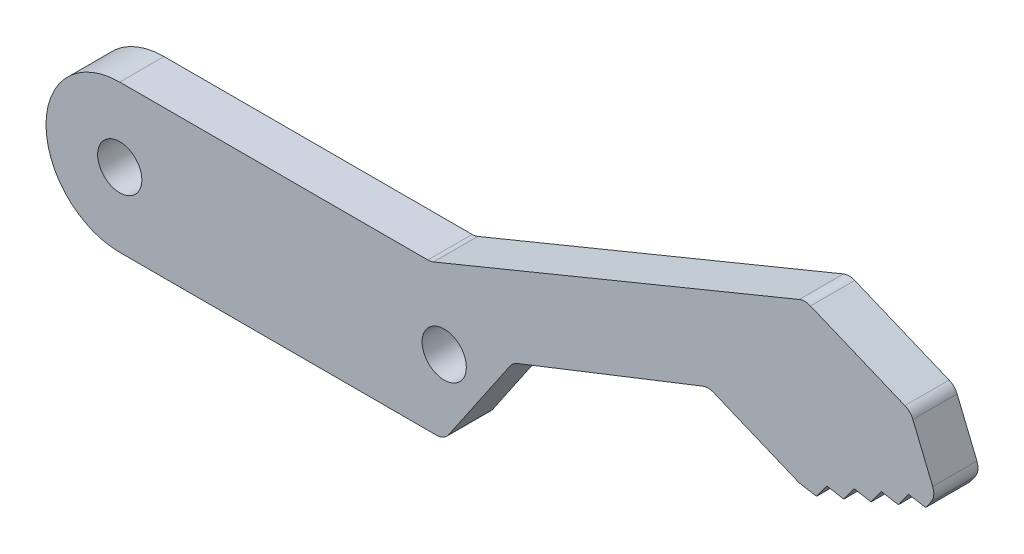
ISO-10303-21;
HEADER;
FILE_DESCRIPTION(('STEP AP214'),'2;1');
FILE_NAME('part.step','',(''),(''),'','','');
FILE_SCHEMA(('AUTOMOTIVE_DESIGN { 1 0 10303 214 1 1 1 1 }'));
ENDSEC;
DATA;
#1=APPLICATION_CONTEXT('core data for automotive mechanical design processes');
#2=APPLICATION_PROTOCOL_DEFINITION('international standard','automotive_design',2000,#1);
#3=PRODUCT_CONTEXT('',#1,'mechanical');
#4=PRODUCT('Part','Part','',(#3));
#5=PRODUCT_RELATED_PRODUCT_CATEGORY('part','',(#4));
#6=PRODUCT_DEFINITION_FORMATION('','',#4);
#7=PRODUCT_DEFINITION_CONTEXT('part definition',#1,'design');
#8=PRODUCT_DEFINITION('design','',#6,#7);
#9=PRODUCT_DEFINITION_SHAPE('','',#8);
#10=(LENGTH_UNIT() NAMED_UNIT(*) SI_UNIT(.MILLI.,.METRE.));
#11=(NAMED_UNIT(*) PLANE_ANGLE_UNIT() SI_UNIT($,.RADIAN.));
#12=(NAMED_UNIT(*) SI_UNIT($,.STERADIAN.) SOLID_ANGLE_UNIT());
#13=UNCERTAINTY_MEASURE_WITH_UNIT(LENGTH_MEASURE(1.E-05),#10,'distance_accuracy_value','');
#14=(GEOMETRIC_REPRESENTATION_CONTEXT(3) GLOBAL_UNCERTAINTY_ASSIGNED_CONTEXT((#13)) GLOBAL_UNIT_ASSIGNED_CONTEXT((#10,
#11,#12)) REPRESENTATION_CONTEXT('',''));
#15=CARTESIAN_POINT('',(0.,0.,0.));
#16=DIRECTION('',(0.,0.,1.));
#17=DIRECTION('',(1.,0.,0.));
#18=AXIS2_PLACEMENT_3D('',#15,#16,#17);
#19=CARTESIAN_POINT('',(0.,5.,3.));
#20=DIRECTION('',(0.,1.,0.));
#21=DIRECTION('',(0.,0.,1.));
#22=AXIS2_PLACEMENT_3D('',#19,#20,#21);
#23=PLANE('',#22);
#24=DIRECTION('',(1.,0.,0.));
#25=VECTOR('',#24,1.);
#26=CARTESIAN_POINT('',(0.,5.,3.));
#27=LINE('',#26,#25);
#28=CARTESIAN_POINT('',(0.,5.,3.));
#29=VERTEX_POINT('',#28);
#30=CARTESIAN_POINT('',(20.8949921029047,5.,3.));
#31=VERTEX_POINT('',#30);
#32=EDGE_CURVE('E224',#29,#31,#27,.T.);
#33=ORIENTED_EDGE('',*,*,#32,.T.);
#34=DIRECTION('',(0.,0.,-1.));
#35=VECTOR('',#34,1.);
#36=CARTESIAN_POINT('',(20.8949921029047,5.,0.));
#37=LINE('',#36,#35);
#38=CARTESIAN_POINT('',(20.8949921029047,5.,0.));
#39=VERTEX_POINT('',#38);
#40=EDGE_CURVE('E424',#31,#39,#37,.T.);
#41=ORIENTED_EDGE('',*,*,#40,.T.);
#42=DIRECTION('',(1.,0.,0.));
#43=VECTOR('',#42,1.);
#44=CARTESIAN_POINT('',(0.,5.,0.));
#45=LINE('',#44,#43);
#46=CARTESIAN_POINT('',(0.,5.,0.));
#47=VERTEX_POINT('',#46);
#48=EDGE_CURVE('E226',#47,#39,#45,.T.);
#49=ORIENTED_EDGE('',*,*,#48,.F.);
#50=DIRECTION('',(0.,0.,-1.));
#51=VECTOR('',#50,1.);
#52=CARTESIAN_POINT('',(0.,5.,3.));
#53=LINE('',#52,#51);
#54=EDGE_CURVE('E218',#29,#47,#53,.T.);
#55=ORIENTED_EDGE('',*,*,#54,.F.);
#56=EDGE_LOOP('',(#33,#41,#49,#55));
#57=FACE_BOUND('',#56,.T.);
#58=ADVANCED_FACE('F39',(#57),#23,.T.);
#59=CARTESIAN_POINT('',(0.,0.,3.));
#60=DIRECTION('',(0.,0.,-1.));
#61=DIRECTION('',(-1.,0.,0.));
#62=AXIS2_PLACEMENT_3D('',#59,#60,#61);
#63=CYLINDRICAL_SURFACE('',#62,5.);
#64=CARTESIAN_POINT('',(0.,0.,0.));
#65=DIRECTION('',(0.,0.,1.));
#66=DIRECTION('',(1.,0.,0.));
#67=AXIS2_PLACEMENT_3D('',#64,#65,#66);
#68=CIRCLE('',#67,5.);
#69=CARTESIAN_POINT('',(0.,-5.,0.));
#70=VERTEX_POINT('',#69);
#71=EDGE_CURVE('E297',#47,#70,#68,.T.);
#72=ORIENTED_EDGE('',*,*,#71,.T.);
#73=DIRECTION('',(0.,0.,-1.));
#74=VECTOR('',#73,1.);
#75=CARTESIAN_POINT('',(0.,-5.,3.));
#76=LINE('',#75,#74);
#77=CARTESIAN_POINT('',(0.,-5.,3.));
#78=VERTEX_POINT('',#77);
#79=EDGE_CURVE('E230',#78,#70,#76,.T.);
#80=ORIENTED_EDGE('',*,*,#79,.F.);
#81=CARTESIAN_POINT('',(0.,0.,3.));
#82=DIRECTION('',(0.,0.,1.));
#83=DIRECTION('',(1.,0.,0.));
#84=AXIS2_PLACEMENT_3D('',#81,#82,#83);
#85=CIRCLE('',#84,5.);
#86=EDGE_CURVE('E234',#29,#78,#85,.T.);
#87=ORIENTED_EDGE('',*,*,#86,.F.);
#88=ORIENTED_EDGE('',*,*,#54,.T.);
#89=EDGE_LOOP('',(#72,#80,#87,#88));
#90=FACE_BOUND('',#89,.T.);
#91=ADVANCED_FACE('F231',(#90),#63,.T.);
#92=CARTESIAN_POINT('',(0.,-5.,3.));
#93=DIRECTION('',(0.,1.,0.));
#94=DIRECTION('',(0.,0.,1.));
#95=AXIS2_PLACEMENT_3D('',#92,#93,#94);
#96=PLANE('',#95);
#97=DIRECTION('',(1.,0.,0.));
#98=VECTOR('',#97,1.);
#99=CARTESIAN_POINT('',(0.,-5.,0.));
#100=LINE('',#99,#98);
#101=CARTESIAN_POINT('',(21.4710317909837,-5.,0.));
#102=VERTEX_POINT('',#101);
#103=EDGE_CURVE('E298',#70,#102,#100,.T.);
#104=ORIENTED_EDGE('',*,*,#103,.T.);
#105=DIRECTION('',(0.,0.,-1.));
#106=VECTOR('',#105,1.);
#107=CARTESIAN_POINT('',(21.4710317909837,-5.,3.));
#108=LINE('',#107,#106);
#109=CARTESIAN_POINT('',(21.4710317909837,-5.,3.));
#110=VERTEX_POINT('',#109);
#111=EDGE_CURVE('E409',#102,#110,#108,.F.);
#112=ORIENTED_EDGE('',*,*,#111,.T.);
#113=DIRECTION('',(1.,0.,0.));
#114=VECTOR('',#113,1.);
#115=CARTESIAN_POINT('',(0.,-5.,3.));
#116=LINE('',#115,#114);
#117=EDGE_CURVE('E236',#78,#110,#116,.T.);
#118=ORIENTED_EDGE('',*,*,#117,.F.);
#119=ORIENTED_EDGE('',*,*,#79,.T.);
#120=EDGE_LOOP('',(#104,#112,#118,#119));
#121=FACE_BOUND('',#120,.T.);
#122=ADVANCED_FACE('F451',(#121),#96,.F.);
#123=CARTESIAN_POINT('',(17.359129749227,-11.817267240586,3.));
#124=DIRECTION('',(0.826637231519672,-0.562735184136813,0.));
#125=DIRECTION('',(0.562735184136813,0.826637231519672,0.));
#126=AXIS2_PLACEMENT_3D('',#123,#124,#125);
#127=PLANE('',#126);
#128=DIRECTION('',(-0.562735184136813,-0.826637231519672,0.));
#129=VECTOR('',#128,1.);
#130=CARTESIAN_POINT('',(17.359129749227,-11.817267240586,3.));
#131=LINE('',#130,#129);
#132=CARTESIAN_POINT('',(26.4784157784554,1.5786276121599,3.));
#133=VERTEX_POINT('',#132);
#134=CARTESIAN_POINT('',(22.2976690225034,-4.56273518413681,3.));
#135=VERTEX_POINT('',#134);
#136=EDGE_CURVE('E253',#133,#135,#131,.T.);
#137=ORIENTED_EDGE('',*,*,#136,.T.);
#138=DIRECTION('',(0.,0.,-1.));
#139=VECTOR('',#138,1.);
#140=CARTESIAN_POINT('',(22.2976690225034,-4.56273518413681,0.));
#141=LINE('',#140,#139);
#142=CARTESIAN_POINT('',(22.2976690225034,-4.56273518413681,0.));
#143=VERTEX_POINT('',#142);
#144=EDGE_CURVE('E403',#135,#143,#141,.T.);
#145=ORIENTED_EDGE('',*,*,#144,.T.);
#146=DIRECTION('',(-0.562735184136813,-0.826637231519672,0.));
#147=VECTOR('',#146,1.);
#148=CARTESIAN_POINT('',(17.359129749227,-11.817267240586,0.));
#149=LINE('',#148,#147);
#150=CARTESIAN_POINT('',(26.4784157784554,1.5786276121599,0.));
#151=VERTEX_POINT('',#150);
#152=EDGE_CURVE('E305',#151,#143,#149,.T.);
#153=ORIENTED_EDGE('',*,*,#152,.F.);
#154=DIRECTION('',(0.,0.,-1.));
#155=VECTOR('',#154,1.);
#156=CARTESIAN_POINT('',(26.4784157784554,1.57862761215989,3.));
#157=LINE('',#156,#155);
#158=EDGE_CURVE('E401',#151,#133,#157,.F.);
#159=ORIENTED_EDGE('',*,*,#158,.T.);
#160=EDGE_LOOP('',(#137,#145,#153,#159));
#161=FACE_BOUND('',#160,.T.);
#162=ADVANCED_FACE('F564',(#161),#127,.T.);
#163=CARTESIAN_POINT('',(2.95764158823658,-7.50469660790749,3.));
#164=DIRECTION('',(0.366658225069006,-0.930355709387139,0.));
#165=DIRECTION('',(0.930355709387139,0.366658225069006,0.));
#166=AXIS2_PLACEMENT_3D('',#163,#164,#165);
#167=PLANE('',#166);
#168=DIRECTION('',(-0.930355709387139,-0.366658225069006,0.));
#169=VECTOR('',#168,1.);
#170=CARTESIAN_POINT('',(2.95764158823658,-7.50469660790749,3.));
#171=LINE('',#170,#169);
#172=CARTESIAN_POINT('',(39.5241557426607,6.90636471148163,3.));
#173=VERTEX_POINT('',#172);
#174=CARTESIAN_POINT('',(26.938394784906,1.94624813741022,3.));
#175=VERTEX_POINT('',#174);
#176=EDGE_CURVE('E255',#173,#175,#171,.T.);
#177=ORIENTED_EDGE('',*,*,#176,.T.);
#178=DIRECTION('',(0.,0.,-1.));
#179=VECTOR('',#178,1.);
#180=CARTESIAN_POINT('',(26.938394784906,1.94624813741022,0.));
#181=LINE('',#180,#179);
#182=CARTESIAN_POINT('',(26.938394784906,1.94624813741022,0.));
#183=VERTEX_POINT('',#182);
#184=EDGE_CURVE('E423',#175,#183,#181,.T.);
#185=ORIENTED_EDGE('',*,*,#184,.T.);
#186=DIRECTION('',(-0.930355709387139,-0.366658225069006,0.));
#187=VECTOR('',#186,1.);
#188=CARTESIAN_POINT('',(2.95764158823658,-7.50469660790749,0.));
#189=LINE('',#188,#187);
#190=CARTESIAN_POINT('',(39.5241557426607,6.90636471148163,0.));
#191=VERTEX_POINT('',#190);
#192=EDGE_CURVE('E303',#191,#183,#189,.T.);
#193=ORIENTED_EDGE('',*,*,#192,.F.);
#194=DIRECTION('',(0.,0.,-1.));
#195=VECTOR('',#194,1.);
#196=CARTESIAN_POINT('',(39.5241557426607,6.90636471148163,3.));
#197=LINE('',#196,#195);
#198=EDGE_CURVE('E420',#191,#173,#197,.F.);
#199=ORIENTED_EDGE('',*,*,#198,.T.);
#200=EDGE_LOOP('',(#177,#185,#193,#199));
#201=FACE_BOUND('',#200,.T.);
#202=ADVANCED_FACE('F487',(#201),#167,.T.);
#203=CARTESIAN_POINT('',(8.33176803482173,20.1242717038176,3.));
#204=DIRECTION('',(-0.382527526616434,-0.923944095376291,0.));
#205=DIRECTION('',(0.923944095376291,-0.382527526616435,0.));
#206=AXIS2_PLACEMENT_3D('',#203,#204,#205);
#207=PLANE('',#206);
#208=DIRECTION('',(-0.923944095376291,0.382527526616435,0.));
#209=VECTOR('',#208,1.);
#210=CARTESIAN_POINT('',(8.33176803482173,20.1242717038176,0.));
#211=LINE('',#210,#209);
#212=CARTESIAN_POINT('',(45.9778971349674,4.53817648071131,0.));
#213=VERTEX_POINT('',#212);
#214=CARTESIAN_POINT('',(40.2733414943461,6.89995309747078,0.));
#215=VERTEX_POINT('',#214);
#216=EDGE_CURVE('E306',#213,#215,#211,.T.);
#217=ORIENTED_EDGE('',*,*,#216,.F.);
#218=DIRECTION('',(0.,0.,-1.));
#219=VECTOR('',#218,1.);
#220=CARTESIAN_POINT('',(45.9778971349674,4.53817648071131,3.));
#221=LINE('',#220,#219);
#222=CARTESIAN_POINT('',(45.9778971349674,4.53817648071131,3.));
#223=VERTEX_POINT('',#222);
#224=EDGE_CURVE('E384',#213,#223,#221,.F.);
#225=ORIENTED_EDGE('',*,*,#224,.T.);
#226=DIRECTION('',(-0.923944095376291,0.382527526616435,0.));
#227=VECTOR('',#226,1.);
#228=CARTESIAN_POINT('',(8.33176803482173,20.1242717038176,3.));
#229=LINE('',#228,#227);
#230=CARTESIAN_POINT('',(40.2733414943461,6.89995309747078,3.));
#231=VERTEX_POINT('',#230);
#232=EDGE_CURVE('E260',#223,#231,#229,.T.);
#233=ORIENTED_EDGE('',*,*,#232,.T.);
#234=DIRECTION('',(0.,0.,-1.));
#235=VECTOR('',#234,1.);
#236=CARTESIAN_POINT('',(40.2733414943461,6.89995309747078,0.));
#237=LINE('',#236,#235);
#238=EDGE_CURVE('E385',#231,#215,#237,.T.);
#239=ORIENTED_EDGE('',*,*,#238,.T.);
#240=EDGE_LOOP('',(#217,#225,#233,#239));
#241=FACE_BOUND('',#240,.T.);
#242=ADVANCED_FACE('F497',(#241),#207,.T.);
#243=CARTESIAN_POINT('',(2.03956322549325,11.9881382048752,3.));
#244=DIRECTION('',(0.167721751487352,0.985834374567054,0.));
#245=DIRECTION('',(-0.985834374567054,0.167721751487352,0.));
#246=AXIS2_PLACEMENT_3D('',#243,#244,#245);
#247=PLANE('',#246);
#248=DIRECTION('',(0.985834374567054,-0.167721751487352,0.));
#249=VECTOR('',#248,1.);
#250=CARTESIAN_POINT('',(2.03956322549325,11.9881382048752,3.));
#251=LINE('',#250,#249);
#252=CARTESIAN_POINT('',(46.1927029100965,4.47628620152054,3.));
#253=VERTEX_POINT('',#252);
#254=CARTESIAN_POINT('',(47.2443622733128,4.29736552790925,3.));
#255=VERTEX_POINT('',#254);
#256=EDGE_CURVE('E257',#253,#255,#251,.T.);
#257=ORIENTED_EDGE('',*,*,#256,.F.);
#258=DIRECTION('',(0.,0.,-1.));
#259=VECTOR('',#258,1.);
#260=CARTESIAN_POINT('',(46.1927029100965,4.47628620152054,0.));
#261=LINE('',#260,#259);
#262=CARTESIAN_POINT('',(46.1927029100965,4.47628620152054,0.));
#263=VERTEX_POINT('',#262);
#264=EDGE_CURVE('E228',#253,#263,#261,.T.);
#265=ORIENTED_EDGE('',*,*,#264,.T.);
#266=DIRECTION('',(0.985834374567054,-0.167721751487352,0.));
#267=VECTOR('',#266,1.);
#268=CARTESIAN_POINT('',(2.03956322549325,11.9881382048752,0.));
#269=LINE('',#268,#267);
#270=CARTESIAN_POINT('',(47.2443622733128,4.29736552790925,0.));
#271=VERTEX_POINT('',#270);
#272=EDGE_CURVE('E313',#263,#271,#269,.T.);
#273=ORIENTED_EDGE('',*,*,#272,.T.);
#274=DIRECTION('',(0.,0.,-1.));
#275=VECTOR('',#274,1.);
#276=CARTESIAN_POINT('',(47.2443622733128,4.29736552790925,3.));
#277=LINE('',#276,#275);
#278=EDGE_CURVE('E368',#255,#271,#277,.T.);
#279=ORIENTED_EDGE('',*,*,#278,.F.);
#280=EDGE_LOOP('',(#257,#265,#273,#279));
#281=FACE_BOUND('',#280,.T.);
#282=ADVANCED_FACE('F502',(#281),#247,.F.);
#283=CARTESIAN_POINT('',(29.1648387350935,-20.9143444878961,3.));
#284=DIRECTION('',(-0.81264720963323,0.582755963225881,0.));
#285=DIRECTION('',(-0.582755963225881,-0.81264720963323,0.));
#286=AXIS2_PLACEMENT_3D('',#283,#284,#285);
#287=PLANE('',#286);
#288=DIRECTION('',(0.582755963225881,0.81264720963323,0.));
#289=VECTOR('',#288,1.);
#290=CARTESIAN_POINT('',(29.1648387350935,-20.9143444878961,0.));
#291=LINE('',#290,#289);
#292=CARTESIAN_POINT('',(47.9315758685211,5.25567783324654,0.));
#293=VERTEX_POINT('',#292);
#294=EDGE_CURVE('E311',#271,#293,#291,.T.);
#295=ORIENTED_EDGE('',*,*,#294,.T.);
#296=DIRECTION('',(0.,0.,-1.));
#297=VECTOR('',#296,1.);
#298=CARTESIAN_POINT('',(47.9315758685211,5.25567783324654,3.));
#299=LINE('',#298,#297);
#300=CARTESIAN_POINT('',(47.9315758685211,5.25567783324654,3.));
#301=VERTEX_POINT('',#300);
#302=EDGE_CURVE('E361',#301,#293,#299,.T.);
#303=ORIENTED_EDGE('',*,*,#302,.F.);
#304=DIRECTION('',(0.582755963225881,0.81264720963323,0.));
#305=VECTOR('',#304,1.);
#306=CARTESIAN_POINT('',(29.1648387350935,-20.9143444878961,3.));
#307=LINE('',#306,#305);
#308=EDGE_CURVE('E265',#255,#301,#307,.T.);
#309=ORIENTED_EDGE('',*,*,#308,.F.);
#310=ORIENTED_EDGE('',*,*,#278,.T.);
#311=EDGE_LOOP('',(#295,#303,#309,#310));
#312=FACE_BOUND('',#311,.T.);
#313=ADVANCED_FACE('F510',(#312),#287,.F.);
#314=CARTESIAN_POINT('',(2.2173479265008,13.0331205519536,3.));
#315=DIRECTION('',(0.167721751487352,0.985834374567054,0.));
#316=DIRECTION('',(-0.985834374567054,0.167721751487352,0.));
#317=AXIS2_PLACEMENT_3D('',#314,#315,#316);
#318=PLANE('',#317);
#319=DIRECTION('',(0.985834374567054,-0.167721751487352,0.));
#320=VECTOR('',#319,1.);
#321=CARTESIAN_POINT('',(2.2173479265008,13.0331205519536,0.));
#322=LINE('',#321,#320);
#323=CARTESIAN_POINT('',(49.0941187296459,5.05789235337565,0.));
#324=VERTEX_POINT('',#323);
#325=EDGE_CURVE('E312',#293,#324,#322,.T.);
#326=ORIENTED_EDGE('',*,*,#325,.T.);
#327=DIRECTION('',(0.,0.,-1.));
#328=VECTOR('',#327,1.);
#329=CARTESIAN_POINT('',(49.0941187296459,5.05789235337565,3.));
#330=LINE('',#329,#328);
#331=CARTESIAN_POINT('',(49.0941187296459,5.05789235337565,3.));
#332=VERTEX_POINT('',#331);
#333=EDGE_CURVE('E358',#332,#324,#330,.T.);
#334=ORIENTED_EDGE('',*,*,#333,.F.);
#335=DIRECTION('',(0.985834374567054,-0.167721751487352,0.));
#336=VECTOR('',#335,1.);
#337=CARTESIAN_POINT('',(2.2173479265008,13.0331205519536,3.));
#338=LINE('',#337,#336);
#339=EDGE_CURVE('E262',#301,#332,#338,.T.);
#340=ORIENTED_EDGE('',*,*,#339,.F.);
#341=ORIENTED_EDGE('',*,*,#302,.T.);
#342=EDGE_LOOP('',(#326,#334,#340,#341));
#343=FACE_BOUND('',#342,.T.);
#344=ADVANCED_FACE('F511',(#343),#318,.F.);
#345=CARTESIAN_POINT('',(30.0262430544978,-21.5320645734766,3.));
#346=DIRECTION('',(-0.81264720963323,0.582755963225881,0.));
#347=DIRECTION('',(-0.582755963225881,-0.812647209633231,0.));
#348=AXIS2_PLACEMENT_3D('',#345,#346,#347);
#349=PLANE('',#348);
#350=DIRECTION('',(0.582755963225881,0.812647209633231,0.));
#351=VECTOR('',#350,1.);
#352=CARTESIAN_POINT('',(30.0262430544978,-21.5320645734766,0.));
#353=LINE('',#352,#351);
#354=CARTESIAN_POINT('',(49.7813323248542,6.01620465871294,0.));
#355=VERTEX_POINT('',#354);
#356=EDGE_CURVE('E320',#324,#355,#353,.T.);
#357=ORIENTED_EDGE('',*,*,#356,.T.);
#358=DIRECTION('',(0.,0.,-1.));
#359=VECTOR('',#358,1.);
#360=CARTESIAN_POINT('',(49.7813323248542,6.01620465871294,3.));
#361=LINE('',#360,#359);
#362=CARTESIAN_POINT('',(49.7813323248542,6.01620465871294,3.));
#363=VERTEX_POINT('',#362);
#364=EDGE_CURVE('E360',#363,#355,#361,.T.);
#365=ORIENTED_EDGE('',*,*,#364,.F.);
#366=DIRECTION('',(0.582755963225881,0.812647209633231,0.));
#367=VECTOR('',#366,1.);
#368=CARTESIAN_POINT('',(30.0262430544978,-21.5320645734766,3.));
#369=LINE('',#368,#367);
#370=EDGE_CURVE('E266',#332,#363,#369,.T.);
#371=ORIENTED_EDGE('',*,*,#370,.F.);
#372=ORIENTED_EDGE('',*,*,#333,.T.);
#373=EDGE_LOOP('',(#357,#365,#371,#372));
#374=FACE_BOUND('',#373,.T.);
#375=ADVANCED_FACE('F517',(#374),#349,.F.);
#376=CARTESIAN_POINT('',(2.39513262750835,14.0781028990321,3.));
#377=DIRECTION('',(0.167721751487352,0.985834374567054,0.));
#378=DIRECTION('',(-0.985834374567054,0.167721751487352,0.));
#379=AXIS2_PLACEMENT_3D('',#376,#377,#378);
#380=PLANE('',#379);
#381=DIRECTION('',(0.985834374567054,-0.167721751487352,0.));
#382=VECTOR('',#381,1.);
#383=CARTESIAN_POINT('',(2.39513262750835,14.0781028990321,0.));
#384=LINE('',#383,#382);
#385=CARTESIAN_POINT('',(50.943875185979,5.81841917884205,0.));
#386=VERTEX_POINT('',#385);
#387=EDGE_CURVE('E317',#355,#386,#384,.T.);
#388=ORIENTED_EDGE('',*,*,#387,.T.);
#389=DIRECTION('',(0.,0.,-1.));
#390=VECTOR('',#389,1.);
#391=CARTESIAN_POINT('',(50.943875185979,5.81841917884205,3.));
#392=LINE('',#391,#390);
#393=CARTESIAN_POINT('',(50.943875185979,5.81841917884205,3.));
#394=VERTEX_POINT('',#393);
#395=EDGE_CURVE('E353',#394,#386,#392,.T.);
#396=ORIENTED_EDGE('',*,*,#395,.F.);
#397=DIRECTION('',(0.985834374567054,-0.167721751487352,0.));
#398=VECTOR('',#397,1.);
#399=CARTESIAN_POINT('',(2.39513262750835,14.0781028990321,3.));
#400=LINE('',#399,#398);
#401=EDGE_CURVE('E268',#363,#394,#400,.T.);
#402=ORIENTED_EDGE('',*,*,#401,.F.);
#403=ORIENTED_EDGE('',*,*,#364,.T.);
#404=EDGE_LOOP('',(#388,#396,#402,#403));
#405=FACE_BOUND('',#404,.T.);
#406=ADVANCED_FACE('F525',(#405),#380,.F.);
#407=CARTESIAN_POINT('',(30.8876473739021,-22.1497846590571,3.));
#408=DIRECTION('',(-0.81264720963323,0.582755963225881,0.));
#409=DIRECTION('',(-0.582755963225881,-0.81264720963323,0.));
#410=AXIS2_PLACEMENT_3D('',#407,#408,#409);
#411=PLANE('',#410);
#412=DIRECTION('',(0.582755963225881,0.81264720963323,0.));
#413=VECTOR('',#412,1.);
#414=CARTESIAN_POINT('',(30.8876473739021,-22.1497846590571,0.));
#415=LINE('',#414,#413);
#416=CARTESIAN_POINT('',(51.6310887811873,6.77673148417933,0.));
#417=VERTEX_POINT('',#416);
#418=EDGE_CURVE('E321',#386,#417,#415,.T.);
#419=ORIENTED_EDGE('',*,*,#418,.T.);
#420=DIRECTION('',(0.,0.,-1.));
#421=VECTOR('',#420,1.);
#422=CARTESIAN_POINT('',(51.6310887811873,6.77673148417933,3.));
#423=LINE('',#422,#421);
#424=CARTESIAN_POINT('',(51.6310887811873,6.77673148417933,3.));
#425=VERTEX_POINT('',#424);
#426=EDGE_CURVE('E351',#425,#417,#423,.T.);
#427=ORIENTED_EDGE('',*,*,#426,.F.);
#428=DIRECTION('',(0.582755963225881,0.81264720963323,0.));
#429=VECTOR('',#428,1.);
#430=CARTESIAN_POINT('',(30.8876473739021,-22.1497846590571,3.));
#431=LINE('',#430,#429);
#432=EDGE_CURVE('E269',#394,#425,#431,.T.);
#433=ORIENTED_EDGE('',*,*,#432,.F.);
#434=ORIENTED_EDGE('',*,*,#395,.T.);
#435=EDGE_LOOP('',(#419,#427,#433,#434));
#436=FACE_BOUND('',#435,.T.);
#437=ADVANCED_FACE('F526',(#436),#411,.F.);
#438=CARTESIAN_POINT('',(2.57291732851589,15.1230852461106,3.));
#439=DIRECTION('',(0.167721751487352,0.985834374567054,0.));
#440=DIRECTION('',(-0.985834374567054,0.167721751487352,0.));
#441=AXIS2_PLACEMENT_3D('',#438,#439,#440);
#442=PLANE('',#441);
#443=DIRECTION('',(0.985834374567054,-0.167721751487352,0.));
#444=VECTOR('',#443,1.);
#445=CARTESIAN_POINT('',(2.57291732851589,15.1230852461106,0.));
#446=LINE('',#445,#444);
#447=CARTESIAN_POINT('',(52.7936316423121,6.57894600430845,0.));
#448=VERTEX_POINT('',#447);
#449=EDGE_CURVE('E323',#417,#448,#446,.T.);
#450=ORIENTED_EDGE('',*,*,#449,.T.);
#451=DIRECTION('',(0.,0.,-1.));
#452=VECTOR('',#451,1.);
#453=CARTESIAN_POINT('',(52.7936316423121,6.57894600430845,3.));
#454=LINE('',#453,#452);
#455=CARTESIAN_POINT('',(52.7936316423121,6.57894600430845,3.));
#456=VERTEX_POINT('',#455);
#457=EDGE_CURVE('E346',#456,#448,#454,.T.);
#458=ORIENTED_EDGE('',*,*,#457,.F.);
#459=DIRECTION('',(0.985834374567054,-0.167721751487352,0.));
#460=VECTOR('',#459,1.);
#461=CARTESIAN_POINT('',(2.57291732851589,15.1230852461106,3.));
#462=LINE('',#461,#460);
#463=EDGE_CURVE('E275',#425,#456,#462,.T.);
#464=ORIENTED_EDGE('',*,*,#463,.F.);
#465=ORIENTED_EDGE('',*,*,#426,.T.);
#466=EDGE_LOOP('',(#450,#458,#464,#465));
#467=FACE_BOUND('',#466,.T.);
#468=ADVANCED_FACE('F535',(#467),#442,.F.);
#469=CARTESIAN_POINT('',(31.7490516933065,-22.7675047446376,3.));
#470=DIRECTION('',(-0.812647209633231,0.58275596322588,0.));
#471=DIRECTION('',(-0.58275596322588,-0.812647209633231,0.));
#472=AXIS2_PLACEMENT_3D('',#469,#470,#471);
#473=PLANE('',#472);
#474=DIRECTION('',(0.58275596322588,0.812647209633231,0.));
#475=VECTOR('',#474,1.);
#476=CARTESIAN_POINT('',(31.7490516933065,-22.7675047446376,0.));
#477=LINE('',#476,#475);
#478=CARTESIAN_POINT('',(53.4808452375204,7.53725830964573,0.));
#479=VERTEX_POINT('',#478);
#480=EDGE_CURVE('E324',#448,#479,#477,.T.);
#481=ORIENTED_EDGE('',*,*,#480,.T.);
#482=DIRECTION('',(0.,0.,-1.));
#483=VECTOR('',#482,1.);
#484=CARTESIAN_POINT('',(53.4808452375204,7.53725830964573,3.));
#485=LINE('',#484,#483);
#486=CARTESIAN_POINT('',(53.4808452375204,7.53725830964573,3.));
#487=VERTEX_POINT('',#486);
#488=EDGE_CURVE('E343',#487,#479,#485,.T.);
#489=ORIENTED_EDGE('',*,*,#488,.F.);
#490=DIRECTION('',(0.58275596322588,0.812647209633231,0.));
#491=VECTOR('',#490,1.);
#492=CARTESIAN_POINT('',(31.7490516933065,-22.7675047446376,3.));
#493=LINE('',#492,#491);
#494=EDGE_CURVE('E273',#456,#487,#493,.T.);
#495=ORIENTED_EDGE('',*,*,#494,.F.);
#496=ORIENTED_EDGE('',*,*,#457,.T.);
#497=EDGE_LOOP('',(#481,#489,#495,#496));
#498=FACE_BOUND('',#497,.T.);
#499=ADVANCED_FACE('F540',(#498),#473,.F.);
#500=CARTESIAN_POINT('',(2.75070202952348,16.1680675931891,3.));
#501=DIRECTION('',(0.167721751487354,0.985834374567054,0.));
#502=DIRECTION('',(-0.985834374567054,0.167721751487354,0.));
#503=AXIS2_PLACEMENT_3D('',#500,#501,#502);
#504=PLANE('',#503);
#505=DIRECTION('',(0.985834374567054,-0.167721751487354,0.));
#506=VECTOR('',#505,1.);
#507=CARTESIAN_POINT('',(2.75070202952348,16.1680675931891,0.));
#508=LINE('',#507,#506);
#509=CARTESIAN_POINT('',(54.6433880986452,7.33947282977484,0.));
#510=VERTEX_POINT('',#509);
#511=EDGE_CURVE('E330',#479,#510,#508,.T.);
#512=ORIENTED_EDGE('',*,*,#511,.T.);
#513=DIRECTION('',(0.,0.,-1.));
#514=VECTOR('',#513,1.);
#515=CARTESIAN_POINT('',(54.6433880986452,7.33947282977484,3.));
#516=LINE('',#515,#514);
#517=CARTESIAN_POINT('',(54.6433880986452,7.33947282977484,3.));
#518=VERTEX_POINT('',#517);
#519=EDGE_CURVE('E293',#518,#510,#516,.T.);
#520=ORIENTED_EDGE('',*,*,#519,.F.);
#521=DIRECTION('',(0.985834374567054,-0.167721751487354,0.));
#522=VECTOR('',#521,1.);
#523=CARTESIAN_POINT('',(2.75070202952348,16.1680675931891,3.));
#524=LINE('',#523,#522);
#525=EDGE_CURVE('E277',#487,#518,#524,.T.);
#526=ORIENTED_EDGE('',*,*,#525,.F.);
#527=ORIENTED_EDGE('',*,*,#488,.T.);
#528=EDGE_LOOP('',(#512,#520,#526,#527));
#529=FACE_BOUND('',#528,.T.);
#530=ADVANCED_FACE('F543',(#529),#504,.F.);
#531=CARTESIAN_POINT('',(32.6104560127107,-23.3852248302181,3.));
#532=DIRECTION('',(-0.81264720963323,0.582755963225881,0.));
#533=DIRECTION('',(-0.582755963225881,-0.81264720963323,0.));
#534=AXIS2_PLACEMENT_3D('',#531,#532,#533);
#535=PLANE('',#534);
#536=DIRECTION('',(0.582755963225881,0.81264720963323,0.));
#537=VECTOR('',#536,1.);
#538=CARTESIAN_POINT('',(32.6104560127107,-23.3852248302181,0.));
#539=LINE('',#538,#537);
#540=CARTESIAN_POINT('',(55.0076105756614,7.84737733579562,0.));
#541=VERTEX_POINT('',#540);
#542=EDGE_CURVE('E328',#510,#541,#539,.T.);
#543=ORIENTED_EDGE('',*,*,#542,.T.);
#544=DIRECTION('',(0.,0.,-1.));
#545=VECTOR('',#544,1.);
#546=CARTESIAN_POINT('',(55.0076105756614,7.84737733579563,3.));
#547=LINE('',#546,#545);
#548=CARTESIAN_POINT('',(55.0076105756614,7.84737733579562,3.));
#549=VERTEX_POINT('',#548);
#550=EDGE_CURVE('E402',#541,#549,#547,.F.);
#551=ORIENTED_EDGE('',*,*,#550,.T.);
#552=DIRECTION('',(0.582755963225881,0.81264720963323,0.));
#553=VECTOR('',#552,1.);
#554=CARTESIAN_POINT('',(32.6104560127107,-23.3852248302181,3.));
#555=LINE('',#554,#553);
#556=EDGE_CURVE('E279',#518,#549,#555,.T.);
#557=ORIENTED_EDGE('',*,*,#556,.F.);
#558=ORIENTED_EDGE('',*,*,#519,.T.);
#559=EDGE_LOOP('',(#543,#551,#557,#558));
#560=FACE_BOUND('',#559,.T.);
#561=ADVANCED_FACE('F550',(#560),#535,.F.);
#562=CARTESIAN_POINT('',(50.2480911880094,20.6594879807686,3.));
#563=DIRECTION('',(0.924878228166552,0.380263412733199,0.));
#564=DIRECTION('',(-0.380263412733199,0.924878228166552,0.));
#565=AXIS2_PLACEMENT_3D('',#562,#563,#564);
#566=PLANE('',#565);
#567=DIRECTION('',(0.380263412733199,-0.924878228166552,0.));
#568=VECTOR('',#567,1.);
#569=CARTESIAN_POINT('',(50.2480911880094,20.6594879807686,3.));
#570=LINE('',#569,#568);
#571=CARTESIAN_POINT('',(53.777547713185,12.0751293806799,3.));
#572=VERTEX_POINT('',#571);
#573=CARTESIAN_POINT('',(55.1198415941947,8.8103967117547,3.));
#574=VERTEX_POINT('',#573);
#575=EDGE_CURVE('E281',#572,#574,#570,.T.);
#576=ORIENTED_EDGE('',*,*,#575,.T.);
#577=DIRECTION('',(0.,0.,-1.));
#578=VECTOR('',#577,1.);
#579=CARTESIAN_POINT('',(55.1198415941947,8.81039671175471,0.));
#580=LINE('',#579,#578);
#581=CARTESIAN_POINT('',(55.1198415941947,8.8103967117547,0.));
#582=VERTEX_POINT('',#581);
#583=EDGE_CURVE('E399',#574,#582,#580,.T.);
#584=ORIENTED_EDGE('',*,*,#583,.T.);
#585=DIRECTION('',(0.380263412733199,-0.924878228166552,0.));
#586=VECTOR('',#585,1.);
#587=CARTESIAN_POINT('',(50.2480911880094,20.6594879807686,0.));
#588=LINE('',#587,#586);
#589=CARTESIAN_POINT('',(53.777547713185,12.0751293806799,0.));
#590=VERTEX_POINT('',#589);
#591=EDGE_CURVE('E335',#590,#582,#588,.T.);
#592=ORIENTED_EDGE('',*,*,#591,.F.);
#593=DIRECTION('',(0.,0.,-1.));
#594=VECTOR('',#593,1.);
#595=CARTESIAN_POINT('',(53.777547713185,12.0751293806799,3.));
#596=LINE('',#595,#594);
#597=EDGE_CURVE('E397',#590,#572,#596,.F.);
#598=ORIENTED_EDGE('',*,*,#597,.T.);
#599=EDGE_LOOP('',(#576,#584,#592,#598));
#600=FACE_BOUND('',#599,.T.);
#601=ADVANCED_FACE('F554',(#600),#566,.T.);
#602=CARTESIAN_POINT('',(12.2496802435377,29.5874648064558,3.));
#603=DIRECTION('',(0.382527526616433,0.923944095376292,0.));
#604=DIRECTION('',(-0.923944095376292,0.382527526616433,0.));
#605=AXIS2_PLACEMENT_3D('',#602,#603,#604);
#606=PLANE('',#605);
#607=DIRECTION('',(0.923944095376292,-0.382527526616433,0.));
#608=VECTOR('',#607,1.);
#609=CARTESIAN_POINT('',(12.2496802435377,29.5874648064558,3.));
#610=LINE('',#609,#608);
#611=CARTESIAN_POINT('',(46.83396435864,15.2690220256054,3.));
#612=VERTEX_POINT('',#611);
#613=CARTESIAN_POINT('',(53.2351970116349,12.618810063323,3.));
#614=VERTEX_POINT('',#613);
#615=EDGE_CURVE('E283',#612,#614,#610,.T.);
#616=ORIENTED_EDGE('',*,*,#615,.T.);
#617=DIRECTION('',(0.,0.,-1.));
#618=VECTOR('',#617,1.);
#619=CARTESIAN_POINT('',(53.2351970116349,12.618810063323,3.));
#620=LINE('',#619,#618);
#621=CARTESIAN_POINT('',(53.2351970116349,12.618810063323,0.));
#622=VERTEX_POINT('',#621);
#623=EDGE_CURVE('E415',#614,#622,#620,.T.);
#624=ORIENTED_EDGE('',*,*,#623,.T.);
#625=DIRECTION('',(0.923944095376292,-0.382527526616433,0.));
#626=VECTOR('',#625,1.);
#627=CARTESIAN_POINT('',(12.2496802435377,29.5874648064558,0.));
#628=LINE('',#627,#626);
#629=CARTESIAN_POINT('',(46.83396435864,15.2690220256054,0.));
#630=VERTEX_POINT('',#629);
#631=EDGE_CURVE('E333',#630,#622,#628,.T.);
#632=ORIENTED_EDGE('',*,*,#631,.F.);
#633=DIRECTION('',(0.,0.,-1.));
#634=VECTOR('',#633,1.);
#635=CARTESIAN_POINT('',(46.83396435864,15.2690220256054,3.));
#636=LINE('',#635,#634);
#637=EDGE_CURVE('E410',#630,#612,#636,.F.);
#638=ORIENTED_EDGE('',*,*,#637,.T.);
#639=EDGE_LOOP('',(#616,#624,#632,#638));
#640=FACE_BOUND('',#639,.T.);
#641=ADVANCED_FACE('F559',(#640),#606,.T.);
#642=CARTESIAN_POINT('',(22.,0.,3.));
#643=DIRECTION('',(0.,0.,-1.));
#644=DIRECTION('',(-1.,0.,0.));
#645=AXIS2_PLACEMENT_3D('',#642,#643,#644);
#646=CYLINDRICAL_SURFACE('',#645,1.5);
#647=CARTESIAN_POINT('',(22.,0.,3.));
#648=DIRECTION('',(0.,0.,1.));
#649=DIRECTION('',(1.,0.,0.));
#650=AXIS2_PLACEMENT_3D('',#647,#648,#649);
#651=CIRCLE('',#650,1.5);
#652=CARTESIAN_POINT('',(23.5,0.,3.));
#653=VERTEX_POINT('',#652);
#654=EDGE_CURVE('E286',#653,#653,#651,.T.);
#655=ORIENTED_EDGE('',*,*,#654,.T.);
#656=EDGE_LOOP('',(#655));
#657=FACE_BOUND('',#656,.T.);
#658=CARTESIAN_POINT('',(22.,0.,0.));
#659=DIRECTION('',(0.,0.,1.));
#660=DIRECTION('',(1.,0.,0.));
#661=AXIS2_PLACEMENT_3D('',#658,#659,#660);
#662=CIRCLE('',#661,1.5);
#663=CARTESIAN_POINT('',(23.5,0.,0.));
#664=VERTEX_POINT('',#663);
#665=EDGE_CURVE('E250',#664,#664,#662,.T.);
#666=ORIENTED_EDGE('',*,*,#665,.F.);
#667=EDGE_LOOP('',(#666));
#668=FACE_BOUND('',#667,.T.);
#669=ADVANCED_FACE('F605',(#657,#668),#646,.F.);
#670=CARTESIAN_POINT('',(1.29150065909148,-3.1411931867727,3.));
#671=DIRECTION('',(-0.380263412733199,0.924878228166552,0.));
#672=DIRECTION('',(-0.924878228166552,-0.380263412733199,0.));
#673=AXIS2_PLACEMENT_3D('',#670,#671,#672);
#674=PLANE('',#673);
#675=DIRECTION('',(0.924878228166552,0.380263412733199,0.));
#676=VECTOR('',#675,1.);
#677=CARTESIAN_POINT('',(1.29150065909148,-3.1411931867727,3.));
#678=LINE('',#677,#676);
#679=CARTESIAN_POINT('',(21.2752555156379,5.07512177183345,3.));
#680=VERTEX_POINT('',#679);
#681=CARTESIAN_POINT('',(46.0711734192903,15.2699561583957,3.));
#682=VERTEX_POINT('',#681);
#683=EDGE_CURVE('E290',#680,#682,#678,.T.);
#684=ORIENTED_EDGE('',*,*,#683,.T.);
#685=DIRECTION('',(0.,0.,-1.));
#686=VECTOR('',#685,1.);
#687=CARTESIAN_POINT('',(46.0711734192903,15.2699561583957,3.));
#688=LINE('',#687,#686);
#689=CARTESIAN_POINT('',(46.0711734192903,15.2699561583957,0.));
#690=VERTEX_POINT('',#689);
#691=EDGE_CURVE('E418',#682,#690,#688,.T.);
#692=ORIENTED_EDGE('',*,*,#691,.T.);
#693=DIRECTION('',(0.924878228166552,0.380263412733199,0.));
#694=VECTOR('',#693,1.);
#695=CARTESIAN_POINT('',(1.29150065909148,-3.1411931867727,0.));
#696=LINE('',#695,#694);
#697=CARTESIAN_POINT('',(21.2752555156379,5.07512177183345,0.));
#698=VERTEX_POINT('',#697);
#699=EDGE_CURVE('E339',#698,#690,#696,.T.);
#700=ORIENTED_EDGE('',*,*,#699,.F.);
#701=DIRECTION('',(0.,0.,-1.));
#702=VECTOR('',#701,1.);
#703=CARTESIAN_POINT('',(21.2752555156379,5.07512177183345,3.));
#704=LINE('',#703,#702);
#705=EDGE_CURVE('E61',#698,#680,#704,.F.);
#706=ORIENTED_EDGE('',*,*,#705,.T.);
#707=EDGE_LOOP('',(#684,#692,#700,#706));
#708=FACE_BOUND('',#707,.T.);
#709=ADVANCED_FACE('F437',(#708),#674,.T.);
#710=CARTESIAN_POINT('',(0.,0.,3.));
#711=DIRECTION('',(0.,0.,-1.));
#712=DIRECTION('',(-1.,0.,0.));
#713=AXIS2_PLACEMENT_3D('',#710,#711,#712);
#714=CYLINDRICAL_SURFACE('',#713,1.5);
#715=CARTESIAN_POINT('',(0.,0.,3.));
#716=DIRECTION('',(0.,0.,1.));
#717=DIRECTION('',(1.,0.,0.));
#718=AXIS2_PLACEMENT_3D('',#715,#716,#717);
#719=CIRCLE('',#718,1.5);
#720=CARTESIAN_POINT('',(1.5,0.,3.));
#721=VERTEX_POINT('',#720);
#722=EDGE_CURVE('E295',#721,#721,#719,.T.);
#723=ORIENTED_EDGE('',*,*,#722,.T.);
#724=EDGE_LOOP('',(#723));
#725=FACE_BOUND('',#724,.T.);
#726=CARTESIAN_POINT('',(0.,0.,0.));
#727=DIRECTION('',(0.,0.,1.));
#728=DIRECTION('',(1.,0.,0.));
#729=AXIS2_PLACEMENT_3D('',#726,#727,#728);
#730=CIRCLE('',#729,1.5);
#731=CARTESIAN_POINT('',(1.5,0.,0.));
#732=VERTEX_POINT('',#731);
#733=EDGE_CURVE('E243',#732,#732,#730,.T.);
#734=ORIENTED_EDGE('',*,*,#733,.F.);
#735=EDGE_LOOP('',(#734));
#736=FACE_BOUND('',#735,.T.);
#737=ADVANCED_FACE('F604',(#725,#736),#714,.F.);
#738=CARTESIAN_POINT('',(0.,0.,3.));
#739=DIRECTION('',(0.,0.,1.));
#740=DIRECTION('',(1.,0.,0.));
#741=AXIS2_PLACEMENT_3D('',#738,#739,#740);
#742=PLANE('',#741);
#743=ORIENTED_EDGE('',*,*,#232,.F.);
#744=CARTESIAN_POINT('',(46.3604246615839,5.4621205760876,3.));
#745=DIRECTION('',(0.,0.,1.));
#746=DIRECTION('',(1.,0.,0.));
#747=AXIS2_PLACEMENT_3D('',#744,#745,#746);
#748=CIRCLE('',#747,1.);
#749=EDGE_CURVE('E393',#223,#253,#748,.T.);
#750=ORIENTED_EDGE('',*,*,#749,.T.);
#751=ORIENTED_EDGE('',*,*,#256,.T.);
#752=ORIENTED_EDGE('',*,*,#308,.T.);
#753=ORIENTED_EDGE('',*,*,#339,.T.);
#754=ORIENTED_EDGE('',*,*,#370,.T.);
#755=ORIENTED_EDGE('',*,*,#401,.T.);
#756=ORIENTED_EDGE('',*,*,#432,.T.);
#757=ORIENTED_EDGE('',*,*,#463,.T.);
#758=ORIENTED_EDGE('',*,*,#494,.T.);
#759=ORIENTED_EDGE('',*,*,#525,.T.);
#760=ORIENTED_EDGE('',*,*,#556,.T.);
#761=CARTESIAN_POINT('',(54.1949633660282,8.43013329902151,3.));
#762=DIRECTION('',(0.,0.,1.));
#763=DIRECTION('',(1.,0.,0.));
#764=AXIS2_PLACEMENT_3D('',#761,#762,#763);
#765=CIRCLE('',#764,1.);
#766=EDGE_CURVE('E392',#549,#574,#765,.T.);
#767=ORIENTED_EDGE('',*,*,#766,.T.);
#768=ORIENTED_EDGE('',*,*,#575,.F.);
#769=CARTESIAN_POINT('',(52.8526694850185,11.6948659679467,3.));
#770=DIRECTION('',(0.,0.,1.));
#771=DIRECTION('',(1.,0.,0.));
#772=AXIS2_PLACEMENT_3D('',#769,#770,#771);
#773=CIRCLE('',#772,1.);
#774=EDGE_CURVE('E389',#572,#614,#773,.T.);
#775=ORIENTED_EDGE('',*,*,#774,.T.);
#776=ORIENTED_EDGE('',*,*,#615,.F.);
#777=CARTESIAN_POINT('',(46.4514368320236,14.3450779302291,3.));
#778=DIRECTION('',(0.,0.,1.));
#779=DIRECTION('',(1.,0.,0.));
#780=AXIS2_PLACEMENT_3D('',#777,#778,#779);
#781=CIRCLE('',#780,1.);
#782=EDGE_CURVE('E53',#612,#682,#781,.T.);
#783=ORIENTED_EDGE('',*,*,#782,.T.);
#784=ORIENTED_EDGE('',*,*,#683,.F.);
#785=CARTESIAN_POINT('',(20.8949921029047,6.,3.));
#786=DIRECTION('',(0.,0.,1.));
#787=DIRECTION('',(1.,0.,0.));
#788=AXIS2_PLACEMENT_3D('',#785,#786,#787);
#789=CIRCLE('',#788,1.);
#790=EDGE_CURVE('E11',#680,#31,#789,.F.);
#791=ORIENTED_EDGE('',*,*,#790,.T.);
#792=ORIENTED_EDGE('',*,*,#32,.F.);
#793=ORIENTED_EDGE('',*,*,#86,.T.);
#794=ORIENTED_EDGE('',*,*,#117,.T.);
#795=CARTESIAN_POINT('',(21.4710317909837,-4.,3.));
#796=DIRECTION('',(0.,0.,1.));
#797=DIRECTION('',(1.,0.,0.));
#798=AXIS2_PLACEMENT_3D('',#795,#796,#797);
#799=CIRCLE('',#798,1.);
#800=EDGE_CURVE('E388',#110,#135,#799,.T.);
#801=ORIENTED_EDGE('',*,*,#800,.T.);
#802=ORIENTED_EDGE('',*,*,#136,.F.);
#803=CARTESIAN_POINT('',(27.305053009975,1.01589242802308,3.));
#804=DIRECTION('',(0.,0.,1.));
#805=DIRECTION('',(1.,0.,0.));
#806=AXIS2_PLACEMENT_3D('',#803,#804,#805);
#807=CIRCLE('',#806,1.);
#808=EDGE_CURVE('E428',#133,#175,#807,.F.);
#809=ORIENTED_EDGE('',*,*,#808,.T.);
#810=ORIENTED_EDGE('',*,*,#176,.F.);
#811=CARTESIAN_POINT('',(39.8908139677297,5.97600900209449,3.));
#812=DIRECTION('',(0.,0.,1.));
#813=DIRECTION('',(1.,0.,0.));
#814=AXIS2_PLACEMENT_3D('',#811,#812,#813);
#815=CIRCLE('',#814,1.);
#816=EDGE_CURVE('E435',#173,#231,#815,.F.);
#817=ORIENTED_EDGE('',*,*,#816,.T.);
#818=EDGE_LOOP('',(#743,#750,#751,#752,#753,#754,#755,#756,#757,#758,#759,#760,#767,#768,#775,
#776,#783,#784,#791,#792,#793,#794,#801,#802,#809,#810,#817));
#819=FACE_BOUND('',#818,.T.);
#820=ORIENTED_EDGE('',*,*,#654,.F.);
#821=EDGE_LOOP('',(#820));
#822=FACE_BOUND('',#821,.T.);
#823=ORIENTED_EDGE('',*,*,#722,.F.);
#824=EDGE_LOOP('',(#823));
#825=FACE_BOUND('',#824,.T.);
#826=ADVANCED_FACE('F241',(#819,#822,#825),#742,.T.);
#827=CARTESIAN_POINT('',(0.,0.,0.));
#828=DIRECTION('',(0.,0.,1.));
#829=DIRECTION('',(1.,0.,0.));
#830=AXIS2_PLACEMENT_3D('',#827,#828,#829);
#831=PLANE('',#830);
#832=ORIENTED_EDGE('',*,*,#272,.F.);
#833=CARTESIAN_POINT('',(46.3604246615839,5.4621205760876,0.));
#834=DIRECTION('',(0.,0.,1.));
#835=DIRECTION('',(1.,0.,0.));
#836=AXIS2_PLACEMENT_3D('',#833,#834,#835);
#837=CIRCLE('',#836,1.);
#838=EDGE_CURVE('E379',#263,#213,#837,.F.);
#839=ORIENTED_EDGE('',*,*,#838,.T.);
#840=ORIENTED_EDGE('',*,*,#216,.T.);
#841=CARTESIAN_POINT('',(39.8908139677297,5.97600900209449,0.));
#842=DIRECTION('',(0.,0.,1.));
#843=DIRECTION('',(1.,0.,0.));
#844=AXIS2_PLACEMENT_3D('',#841,#842,#843);
#845=CIRCLE('',#844,1.);
#846=EDGE_CURVE('E429',#215,#191,#845,.T.);
#847=ORIENTED_EDGE('',*,*,#846,.T.);
#848=ORIENTED_EDGE('',*,*,#192,.T.);
#849=CARTESIAN_POINT('',(27.305053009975,1.01589242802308,0.));
#850=DIRECTION('',(0.,0.,1.));
#851=DIRECTION('',(1.,0.,0.));
#852=AXIS2_PLACEMENT_3D('',#849,#850,#851);
#853=CIRCLE('',#852,1.);
#854=EDGE_CURVE('E426',#183,#151,#853,.T.);
#855=ORIENTED_EDGE('',*,*,#854,.T.);
#856=ORIENTED_EDGE('',*,*,#152,.T.);
#857=CARTESIAN_POINT('',(21.4710317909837,-4.,0.));
#858=DIRECTION('',(0.,0.,1.));
#859=DIRECTION('',(1.,0.,0.));
#860=AXIS2_PLACEMENT_3D('',#857,#858,#859);
#861=CIRCLE('',#860,1.);
#862=EDGE_CURVE('E376',#143,#102,#861,.F.);
#863=ORIENTED_EDGE('',*,*,#862,.T.);
#864=ORIENTED_EDGE('',*,*,#103,.F.);
#865=ORIENTED_EDGE('',*,*,#71,.F.);
#866=ORIENTED_EDGE('',*,*,#48,.T.);
#867=CARTESIAN_POINT('',(20.8949921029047,6.,0.));
#868=DIRECTION('',(0.,0.,1.));
#869=DIRECTION('',(1.,0.,0.));
#870=AXIS2_PLACEMENT_3D('',#867,#868,#869);
#871=CIRCLE('',#870,1.);
#872=EDGE_CURVE('E50',#39,#698,#871,.T.);
#873=ORIENTED_EDGE('',*,*,#872,.T.);
#874=ORIENTED_EDGE('',*,*,#699,.T.);
#875=CARTESIAN_POINT('',(46.4514368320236,14.3450779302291,0.));
#876=DIRECTION('',(0.,0.,1.));
#877=DIRECTION('',(1.,0.,0.));
#878=AXIS2_PLACEMENT_3D('',#875,#876,#877);
#879=CIRCLE('',#878,1.);
#880=EDGE_CURVE('E375',#690,#630,#879,.F.);
#881=ORIENTED_EDGE('',*,*,#880,.T.);
#882=ORIENTED_EDGE('',*,*,#631,.T.);
#883=CARTESIAN_POINT('',(52.8526694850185,11.6948659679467,0.));
#884=DIRECTION('',(0.,0.,1.));
#885=DIRECTION('',(1.,0.,0.));
#886=AXIS2_PLACEMENT_3D('',#883,#884,#885);
#887=CIRCLE('',#886,1.);
#888=EDGE_CURVE('E372',#622,#590,#887,.F.);
#889=ORIENTED_EDGE('',*,*,#888,.T.);
#890=ORIENTED_EDGE('',*,*,#591,.T.);
#891=CARTESIAN_POINT('',(54.1949633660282,8.43013329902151,0.));
#892=DIRECTION('',(0.,0.,1.));
#893=DIRECTION('',(1.,0.,0.));
#894=AXIS2_PLACEMENT_3D('',#891,#892,#893);
#895=CIRCLE('',#894,1.);
#896=EDGE_CURVE('E378',#582,#541,#895,.F.);
#897=ORIENTED_EDGE('',*,*,#896,.T.);
#898=ORIENTED_EDGE('',*,*,#542,.F.);
#899=ORIENTED_EDGE('',*,*,#511,.F.);
#900=ORIENTED_EDGE('',*,*,#480,.F.);
#901=ORIENTED_EDGE('',*,*,#449,.F.);
#902=ORIENTED_EDGE('',*,*,#418,.F.);
#903=ORIENTED_EDGE('',*,*,#387,.F.);
#904=ORIENTED_EDGE('',*,*,#356,.F.);
#905=ORIENTED_EDGE('',*,*,#325,.F.);
#906=ORIENTED_EDGE('',*,*,#294,.F.);
#907=EDGE_LOOP('',(#832,#839,#840,#847,#848,#855,#856,#863,#864,#865,#866,#873,#874,#881,#882,
#889,#890,#897,#898,#899,#900,#901,#902,#903,#904,#905,#906));
#908=FACE_BOUND('',#907,.T.);
#909=ORIENTED_EDGE('',*,*,#665,.T.);
#910=EDGE_LOOP('',(#909));
#911=FACE_BOUND('',#910,.T.);
#912=ORIENTED_EDGE('',*,*,#733,.T.);
#913=EDGE_LOOP('',(#912));
#914=FACE_BOUND('',#913,.T.);
#915=ADVANCED_FACE('F434',(#908,#911,#914),#831,.F.);
#916=CARTESIAN_POINT('',(46.3604246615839,5.4621205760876,3.));
#917=DIRECTION('',(0.,0.,1.));
#918=DIRECTION('',(1.,0.,0.));
#919=AXIS2_PLACEMENT_3D('',#916,#917,#918);
#920=CYLINDRICAL_SURFACE('',#919,1.);
#921=ORIENTED_EDGE('',*,*,#749,.F.);
#922=ORIENTED_EDGE('',*,*,#224,.F.);
#923=ORIENTED_EDGE('',*,*,#838,.F.);
#924=ORIENTED_EDGE('',*,*,#264,.F.);
#925=EDGE_LOOP('',(#921,#922,#923,#924));
#926=FACE_BOUND('',#925,.T.);
#927=ADVANCED_FACE('F456',(#926),#920,.T.);
#928=CARTESIAN_POINT('',(54.1949633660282,8.43013329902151,3.));
#929=DIRECTION('',(0.,0.,1.));
#930=DIRECTION('',(1.,0.,0.));
#931=AXIS2_PLACEMENT_3D('',#928,#929,#930);
#932=CYLINDRICAL_SURFACE('',#931,1.);
#933=ORIENTED_EDGE('',*,*,#766,.F.);
#934=ORIENTED_EDGE('',*,*,#550,.F.);
#935=ORIENTED_EDGE('',*,*,#896,.F.);
#936=ORIENTED_EDGE('',*,*,#583,.F.);
#937=EDGE_LOOP('',(#933,#934,#935,#936));
#938=FACE_BOUND('',#937,.T.);
#939=ADVANCED_FACE('F461',(#938),#932,.T.);
#940=CARTESIAN_POINT('',(21.4710317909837,-4.,3.));
#941=DIRECTION('',(0.,0.,1.));
#942=DIRECTION('',(1.,0.,0.));
#943=AXIS2_PLACEMENT_3D('',#940,#941,#942);
#944=CYLINDRICAL_SURFACE('',#943,1.);
#945=ORIENTED_EDGE('',*,*,#800,.F.);
#946=ORIENTED_EDGE('',*,*,#111,.F.);
#947=ORIENTED_EDGE('',*,*,#862,.F.);
#948=ORIENTED_EDGE('',*,*,#144,.F.);
#949=EDGE_LOOP('',(#945,#946,#947,#948));
#950=FACE_BOUND('',#949,.T.);
#951=ADVANCED_FACE('F465',(#950),#944,.T.);
#952=CARTESIAN_POINT('',(52.8526694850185,11.6948659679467,3.));
#953=DIRECTION('',(0.,0.,-1.));
#954=DIRECTION('',(-1.,0.,0.));
#955=AXIS2_PLACEMENT_3D('',#952,#953,#954);
#956=CYLINDRICAL_SURFACE('',#955,1.);
#957=ORIENTED_EDGE('',*,*,#774,.F.);
#958=ORIENTED_EDGE('',*,*,#597,.F.);
#959=ORIENTED_EDGE('',*,*,#888,.F.);
#960=ORIENTED_EDGE('',*,*,#623,.F.);
#961=EDGE_LOOP('',(#957,#958,#959,#960));
#962=FACE_BOUND('',#961,.T.);
#963=ADVANCED_FACE('F466',(#962),#956,.T.);
#964=CARTESIAN_POINT('',(46.4514368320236,14.3450779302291,3.));
#965=DIRECTION('',(0.,0.,-1.));
#966=DIRECTION('',(-1.,0.,0.));
#967=AXIS2_PLACEMENT_3D('',#964,#965,#966);
#968=CYLINDRICAL_SURFACE('',#967,1.);
#969=ORIENTED_EDGE('',*,*,#782,.F.);
#970=ORIENTED_EDGE('',*,*,#637,.F.);
#971=ORIENTED_EDGE('',*,*,#880,.F.);
#972=ORIENTED_EDGE('',*,*,#691,.F.);
#973=EDGE_LOOP('',(#969,#970,#971,#972));
#974=FACE_BOUND('',#973,.T.);
#975=ADVANCED_FACE('F471',(#974),#968,.T.);
#976=CARTESIAN_POINT('',(27.305053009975,1.01589242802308,3.));
#977=DIRECTION('',(0.,0.,1.));
#978=DIRECTION('',(1.,0.,0.));
#979=AXIS2_PLACEMENT_3D('',#976,#977,#978);
#980=CYLINDRICAL_SURFACE('',#979,1.);
#981=ORIENTED_EDGE('',*,*,#808,.F.);
#982=ORIENTED_EDGE('',*,*,#158,.F.);
#983=ORIENTED_EDGE('',*,*,#854,.F.);
#984=ORIENTED_EDGE('',*,*,#184,.F.);
#985=EDGE_LOOP('',(#981,#982,#983,#984));
#986=FACE_BOUND('',#985,.T.);
#987=ADVANCED_FACE('F443',(#986),#980,.F.);
#988=CARTESIAN_POINT('',(39.8908139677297,5.97600900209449,3.));
#989=DIRECTION('',(0.,0.,1.));
#990=DIRECTION('',(1.,0.,0.));
#991=AXIS2_PLACEMENT_3D('',#988,#989,#990);
#992=CYLINDRICAL_SURFACE('',#991,1.);
#993=ORIENTED_EDGE('',*,*,#816,.F.);
#994=ORIENTED_EDGE('',*,*,#198,.F.);
#995=ORIENTED_EDGE('',*,*,#846,.F.);
#996=ORIENTED_EDGE('',*,*,#238,.F.);
#997=EDGE_LOOP('',(#993,#994,#995,#996));
#998=FACE_BOUND('',#997,.T.);
#999=ADVANCED_FACE('F442',(#998),#992,.F.);
#1000=CARTESIAN_POINT('',(20.8949921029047,6.,3.));
#1001=DIRECTION('',(0.,0.,1.));
#1002=DIRECTION('',(1.,0.,0.));
#1003=AXIS2_PLACEMENT_3D('',#1000,#1001,#1002);
#1004=CYLINDRICAL_SURFACE('',#1003,1.);
#1005=ORIENTED_EDGE('',*,*,#790,.F.);
#1006=ORIENTED_EDGE('',*,*,#705,.F.);
#1007=ORIENTED_EDGE('',*,*,#872,.F.);
#1008=ORIENTED_EDGE('',*,*,#40,.F.);
#1009=EDGE_LOOP('',(#1005,#1006,#1007,#1008));
#1010=FACE_BOUND('',#1009,.T.);
#1011=ADVANCED_FACE('F41',(#1010),#1004,.F.);
#1012=CLOSED_SHELL('',(#58,#91,#122,#162,#202,#242,#282,#313,#344,#375,#406,#437,#468,#499,#530,
#561,#601,#641,#669,#709,#737,#826,#915,#927,#939,#951,#963,#975,#987,#999,#1011));
#1013=MANIFOLD_SOLID_BREP('B2',#1012);
#1014=ADVANCED_BREP_SHAPE_REPRESENTATION('',(#18,#1013),#14);
#1015=SHAPE_DEFINITION_REPRESENTATION(#9,#1014);
ENDSEC;
END-ISO-10303-21;
